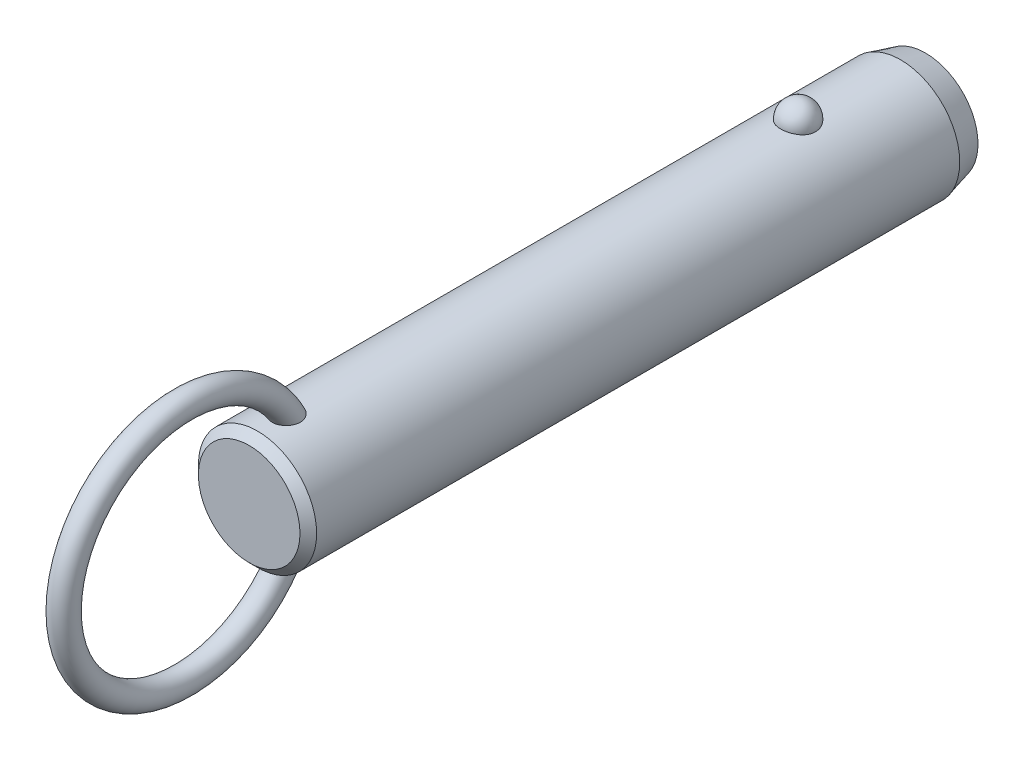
ISO-10303-21;
HEADER;
FILE_DESCRIPTION(('STEP AP214'),'2;1');
FILE_NAME('part.step','',(''),(''),'','','');
FILE_SCHEMA(('AUTOMOTIVE_DESIGN { 1 0 10303 214 1 1 1 1 }'));
ENDSEC;
DATA;
#1=APPLICATION_CONTEXT('core data for automotive mechanical design processes');
#2=APPLICATION_PROTOCOL_DEFINITION('international standard','automotive_design',2000,#1);
#3=PRODUCT_CONTEXT('',#1,'mechanical');
#4=PRODUCT('Part','Part','',(#3));
#5=PRODUCT_RELATED_PRODUCT_CATEGORY('part','',(#4));
#6=PRODUCT_DEFINITION_FORMATION('','',#4);
#7=PRODUCT_DEFINITION_CONTEXT('part definition',#1,'design');
#8=PRODUCT_DEFINITION('design','',#6,#7);
#9=PRODUCT_DEFINITION_SHAPE('','',#8);
#10=(LENGTH_UNIT() NAMED_UNIT(*) SI_UNIT(.MILLI.,.METRE.));
#11=(NAMED_UNIT(*) PLANE_ANGLE_UNIT() SI_UNIT($,.RADIAN.));
#12=(NAMED_UNIT(*) SI_UNIT($,.STERADIAN.) SOLID_ANGLE_UNIT());
#13=UNCERTAINTY_MEASURE_WITH_UNIT(LENGTH_MEASURE(1.E-05),#10,'distance_accuracy_value','');
#14=(GEOMETRIC_REPRESENTATION_CONTEXT(3) GLOBAL_UNCERTAINTY_ASSIGNED_CONTEXT((#13)) GLOBAL_UNIT_ASSIGNED_CONTEXT((#10,
#11,#12)) REPRESENTATION_CONTEXT('',''));
#15=CARTESIAN_POINT('',(0.,0.,0.));
#16=DIRECTION('',(0.,0.,1.));
#17=DIRECTION('',(1.,0.,0.));
#18=AXIS2_PLACEMENT_3D('',#15,#16,#17);
#19=CARTESIAN_POINT('',(0.,0.,55.9));
#20=DIRECTION('',(0.,0.,-1.));
#21=DIRECTION('',(-1.,0.,0.));
#22=AXIS2_PLACEMENT_3D('',#19,#20,#21);
#23=CYLINDRICAL_SURFACE('',#22,7.1);
#24=CARTESIAN_POINT('',(2.0769088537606,6.78943661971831,-2.1));
#25=CARTESIAN_POINT('',(2.07690739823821,6.78943796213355,-1.98268154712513));
#26=CARTESIAN_POINT('',(2.06738130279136,6.79237331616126,-1.86534506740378));
#27=CARTESIAN_POINT('',(2.0295040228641,6.8037853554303,-1.63400788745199));
#28=CARTESIAN_POINT('',(2.00114757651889,6.81226358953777,-1.52000812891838));
#29=CARTESIAN_POINT('',(1.92632025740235,6.83379798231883,-1.29863433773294));
#30=CARTESIAN_POINT('',(1.87985726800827,6.84685214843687,-1.19125744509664));
#31=CARTESIAN_POINT('',(1.76995205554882,6.87608091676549,-0.98604657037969));
#32=CARTESIAN_POINT('',(1.70650980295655,6.8922555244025,-0.88821260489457));
#33=CARTESIAN_POINT('',(1.5638119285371,6.92602930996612,-0.704242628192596));
#34=CARTESIAN_POINT('',(1.4844714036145,6.94363582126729,-0.618173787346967));
#35=CARTESIAN_POINT('',(1.31221746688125,6.97823658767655,-0.460740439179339));
#36=CARTESIAN_POINT('',(1.21930409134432,6.99523084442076,-0.389375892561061));
#37=CARTESIAN_POINT('',(1.02268781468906,7.02666176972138,-0.263547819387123));
#38=CARTESIAN_POINT('',(0.91902009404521,7.04110638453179,-0.209031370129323));
#39=CARTESIAN_POINT('',(0.703548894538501,7.06588726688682,-0.118163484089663));
#40=CARTESIAN_POINT('',(0.591746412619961,7.07622403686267,-0.0818098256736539));
#41=CARTESIAN_POINT('',(0.365557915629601,7.09147068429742,-0.0288711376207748));
#42=CARTESIAN_POINT('',(0.251267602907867,7.09648447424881,-0.0119070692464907));
#43=CARTESIAN_POINT('',(0.0213499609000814,7.10089837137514,0.00304925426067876));
#44=CARTESIAN_POINT('',(-0.0942772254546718,7.10029907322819,0.00104351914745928));
#45=CARTESIAN_POINT('',(-0.321651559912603,7.09360829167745,-0.0216931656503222));
#46=CARTESIAN_POINT('',(-0.433431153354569,7.08760388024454,-0.0421272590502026));
#47=CARTESIAN_POINT('',(-0.651862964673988,7.07086131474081,-0.100729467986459));
#48=CARTESIAN_POINT('',(-0.758515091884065,7.06012307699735,-0.138897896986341));
#49=CARTESIAN_POINT('',(-0.964449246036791,7.03496097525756,-0.232213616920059));
#50=CARTESIAN_POINT('',(-1.06368095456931,7.02051445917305,-0.287465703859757));
#51=CARTESIAN_POINT('',(-1.25145353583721,6.98948740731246,-0.413383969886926));
#52=CARTESIAN_POINT('',(-1.33999321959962,6.97290663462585,-0.48405186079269));
#53=CARTESIAN_POINT('',(-1.50591604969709,6.93898770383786,-0.640594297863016));
#54=CARTESIAN_POINT('',(-1.58302488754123,6.92164094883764,-0.726757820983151));
#55=CARTESIAN_POINT('',(-1.72189320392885,6.8884103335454,-0.91092752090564));
#56=CARTESIAN_POINT('',(-1.78365144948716,6.87252659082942,-1.008934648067));
#57=CARTESIAN_POINT('',(-1.89101272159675,6.84377189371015,-1.21549497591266));
#58=CARTESIAN_POINT('',(-1.93639553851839,6.83094274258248,-1.32416860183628));
#59=CARTESIAN_POINT('',(-2.00874275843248,6.81002070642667,-1.54791500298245));
#60=CARTESIAN_POINT('',(-2.03570774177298,6.80192767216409,-1.66298757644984));
#61=CARTESIAN_POINT('',(-2.07047276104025,6.7914266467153,-1.89571453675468));
#62=CARTESIAN_POINT('',(-2.07835878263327,6.78899315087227,-2.01335491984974));
#63=CARTESIAN_POINT('',(-2.07502083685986,6.79001409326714,-2.24833570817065));
#64=CARTESIAN_POINT('',(-2.06379746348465,6.7934683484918,-2.36567612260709));
#65=CARTESIAN_POINT('',(-2.02263913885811,6.80583442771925,-2.59603194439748));
#66=CARTESIAN_POINT('',(-1.99281127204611,6.81471501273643,-2.70906820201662));
#67=CARTESIAN_POINT('',(-1.91526639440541,6.83691232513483,-2.92836575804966));
#68=CARTESIAN_POINT('',(-1.8675486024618,6.85022924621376,-3.03462676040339));
#69=CARTESIAN_POINT('',(-1.75504492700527,6.87991336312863,-3.23806487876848));
#70=CARTESIAN_POINT('',(-1.69015924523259,6.89629822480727,-3.33518422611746));
#71=CARTESIAN_POINT('',(-1.54505404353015,6.93024852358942,-3.51697105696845));
#72=CARTESIAN_POINT('',(-1.46483385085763,6.94781401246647,-3.60163799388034));
#73=CARTESIAN_POINT('',(-1.29071406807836,6.98225977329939,-3.75654119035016));
#74=CARTESIAN_POINT('',(-1.19675650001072,6.99913673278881,-3.82671308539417));
#75=CARTESIAN_POINT('',(-0.997940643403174,7.03023618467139,-3.9501837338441));
#76=CARTESIAN_POINT('',(-0.89308318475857,7.04445887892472,-4.00348377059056));
#77=CARTESIAN_POINT('',(-0.676902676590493,7.06848365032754,-4.09107242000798));
#78=CARTESIAN_POINT('',(-0.565686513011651,7.0783430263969,-4.12560889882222));
#79=CARTESIAN_POINT('',(-0.338739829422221,7.09282534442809,-4.17575450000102));
#80=CARTESIAN_POINT('',(-0.223009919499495,7.09744899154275,-4.19136617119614));
#81=CARTESIAN_POINT('',(0.00707628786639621,7.10090930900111,-4.20307965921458));
#82=CARTESIAN_POINT('',(0.121410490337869,7.09986531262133,-4.19958377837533));
#83=CARTESIAN_POINT('',(0.347815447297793,7.092380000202,-4.17411564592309));
#84=CARTESIAN_POINT('',(0.459886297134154,7.08593891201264,-4.15214417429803));
#85=CARTESIAN_POINT('',(0.678084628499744,7.06838983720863,-4.09049562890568));
#86=CARTESIAN_POINT('',(0.784237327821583,7.05730369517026,-4.05090137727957));
#87=CARTESIAN_POINT('',(0.988305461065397,7.03163139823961,-3.95511447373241));
#88=CARTESIAN_POINT('',(1.08622031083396,7.01704499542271,-3.89892064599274));
#89=CARTESIAN_POINT('',(1.27284490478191,6.98562668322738,-3.77035541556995));
#90=CARTESIAN_POINT('',(1.36137372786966,6.96876135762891,-3.69772964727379));
#91=CARTESIAN_POINT('',(1.52509486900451,6.93477412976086,-3.53878279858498));
#92=CARTESIAN_POINT('',(1.60028496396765,6.91765218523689,-3.45245943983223));
#93=CARTESIAN_POINT('',(1.73681688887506,6.88465753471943,-3.26658774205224));
#94=CARTESIAN_POINT('',(1.79785966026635,6.86881574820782,-3.16681408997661));
#95=CARTESIAN_POINT('',(1.90265327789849,6.84053157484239,-2.95814408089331));
#96=CARTESIAN_POINT('',(1.94640861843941,6.82808830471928,-2.84925010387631));
#97=CARTESIAN_POINT('',(2.01274378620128,6.80881460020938,-2.63454318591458));
#98=CARTESIAN_POINT('',(2.03676193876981,6.80160856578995,-2.52920574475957));
#99=CARTESIAN_POINT('',(2.06884490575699,6.79191902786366,-2.3159172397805));
#100=CARTESIAN_POINT('',(2.07691019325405,6.78943538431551,-2.20796625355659));
#101=CARTESIAN_POINT('',(2.0769088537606,6.78943661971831,-2.1));
#102=B_SPLINE_CURVE_WITH_KNOTS('',3,(#24,#25,#26,#27,#28,#29,#30,#31,#32,#33,#34,#35,#36,#37,
#38,#39,#40,#41,#42,#43,#44,#45,#46,#47,#48,#49,#50,#51,#52,#53,#54,#55,#56,#57,#58,#59,#60,#61,
#62,#63,#64,#65,#66,#67,#68,#69,#70,#71,#72,#73,#74,#75,#76,#77,#78,#79,#80,#81,#82,#83,#84,#85,
#86,#87,#88,#89,#90,#91,#92,#93,#94,#95,#96,#97,#98,#99,#100,#101),.UNSPECIFIED.,.T.,.F.,(4,2,2,
2,2,2,2,2,2,2,2,2,2,2,2,2,2,2,2,2,2,2,2,2,2,2,2,2,2,2,2,2,2,2,2,2,2,2,4),(0.,0.351568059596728,
0.703234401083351,1.05474780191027,1.40626181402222,1.75970563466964,2.11314851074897,
2.4654696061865,2.81774759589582,3.16301449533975,3.50824481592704,3.84801136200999,
4.18778391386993,4.52968352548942,4.87162112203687,5.22076181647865,5.56993054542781,
5.92363364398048,6.27732559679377,6.62942052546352,6.98150450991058,7.33158042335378,
7.68167162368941,8.03384443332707,8.38603269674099,8.73975272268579,9.09344583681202,
9.44234545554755,9.79119807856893,10.1327344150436,10.4742563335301,10.8141898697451,
11.1541474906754,11.4997793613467,11.8454687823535,12.1979079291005,12.5502553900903,
12.8738073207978,13.1973496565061),.UNSPECIFIED.);
#103=CARTESIAN_POINT('',(2.0769088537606,6.78943661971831,-2.1));
#104=VERTEX_POINT('',#103);
#105=EDGE_CURVE('E41',#104,#104,#102,.T.);
#106=ORIENTED_EDGE('',*,*,#105,.T.);
#107=EDGE_LOOP('',(#106));
#108=FACE_BOUND('',#107,.T.);
#109=CARTESIAN_POINT('',(0.,0.,62.82));
#110=DIRECTION('',(0.,0.,1.));
#111=DIRECTION('',(1.,0.,0.));
#112=AXIS2_PLACEMENT_3D('',#109,#110,#111);
#113=CIRCLE('',#112,7.1);
#114=CARTESIAN_POINT('',(7.1,0.,62.82));
#115=VERTEX_POINT('',#114);
#116=EDGE_CURVE('E10',#115,#115,#113,.F.);
#117=ORIENTED_EDGE('',*,*,#116,.T.);
#118=EDGE_LOOP('',(#117));
#119=FACE_BOUND('',#118,.T.);
#120=CARTESIAN_POINT('',(-0.429539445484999,-7.08699541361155,57.6429212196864));
#121=CARTESIAN_POINT('',(-0.508331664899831,-7.08221999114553,57.6668764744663));
#122=CARTESIAN_POINT('',(-0.585039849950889,-7.07624016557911,57.6974570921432));
#123=CARTESIAN_POINT('',(-0.732082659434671,-7.06254296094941,57.7710242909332));
#124=CARTESIAN_POINT('',(-0.802417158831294,-7.05482554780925,57.8140111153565));
#125=CARTESIAN_POINT('',(-0.934722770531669,-7.03851844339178,57.9111135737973));
#126=CARTESIAN_POINT('',(-0.996700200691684,-7.02992941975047,57.9652207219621));
#127=CARTESIAN_POINT('',(-1.11079942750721,-7.01280697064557,58.0829676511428));
#128=CARTESIAN_POINT('',(-1.16292136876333,-7.00427354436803,58.1466072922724));
#129=CARTESIAN_POINT('',(-1.25705660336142,-6.98799959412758,58.2826870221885));
#130=CARTESIAN_POINT('',(-1.29888032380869,-6.98027525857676,58.3552598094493));
#131=CARTESIAN_POINT('',(-1.37069920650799,-6.96652886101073,58.5061686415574));
#132=CARTESIAN_POINT('',(-1.40069157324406,-6.96050720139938,58.5845060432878));
#133=CARTESIAN_POINT('',(-1.45043507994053,-6.95031881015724,58.7501903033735));
#134=CARTESIAN_POINT('',(-1.46937115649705,-6.94630231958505,58.8377897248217));
#135=CARTESIAN_POINT('',(-1.49424917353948,-6.94099239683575,59.0148714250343));
#136=CARTESIAN_POINT('',(-1.50018601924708,-6.93970003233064,59.1043544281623));
#137=CARTESIAN_POINT('',(-1.49978214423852,-6.93978815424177,59.2940607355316));
#138=CARTESIAN_POINT('',(-1.49187639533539,-6.94150934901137,59.394279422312));
#139=CARTESIAN_POINT('',(-1.46177925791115,-6.94790814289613,59.5924798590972));
#140=CARTESIAN_POINT('',(-1.43957541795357,-6.95258831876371,59.690459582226));
#141=CARTESIAN_POINT('',(-1.37783293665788,-6.96510647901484,59.8953629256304));
#142=CARTESIAN_POINT('',(-1.33634073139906,-6.97328848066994,60.0016801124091));
#143=CARTESIAN_POINT('',(-1.23686994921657,-6.99161706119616,60.2061777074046));
#144=CARTESIAN_POINT('',(-1.17889192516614,-7.00176357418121,60.3043583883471));
#145=CARTESIAN_POINT('',(-1.0587512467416,-7.02082898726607,60.4723743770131));
#146=CARTESIAN_POINT('',(-0.999247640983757,-7.02963746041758,60.5441230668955));
#147=CARTESIAN_POINT('',(-0.869494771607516,-7.04686074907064,60.6771959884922));
#148=CARTESIAN_POINT('',(-0.79926347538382,-7.05527619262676,60.7385372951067));
#149=CARTESIAN_POINT('',(-0.665408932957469,-7.06899457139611,60.8351316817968));
#150=CARTESIAN_POINT('',(-0.603817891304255,-7.07457275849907,60.8731512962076));
#151=CARTESIAN_POINT('',(-0.475172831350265,-7.08437420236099,60.9387581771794));
#152=CARTESIAN_POINT('',(-0.408123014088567,-7.08859848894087,60.9663533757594));
#153=CARTESIAN_POINT('',(-0.269431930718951,-7.09522749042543,61.0092569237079));
#154=CARTESIAN_POINT('',(-0.19775731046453,-7.09761688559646,61.0244618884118));
#155=CARTESIAN_POINT('',(-0.0527849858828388,-7.10017268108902,61.0407168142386));
#156=CARTESIAN_POINT('',(0.0205115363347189,-7.10034065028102,61.0417767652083));
#157=CARTESIAN_POINT('',(0.156426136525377,-7.09855986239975,61.0304619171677));
#158=CARTESIAN_POINT('',(0.219199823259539,-7.09688191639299,61.0198060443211));
#159=CARTESIAN_POINT('',(0.342134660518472,-7.09201880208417,60.9885379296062));
#160=CARTESIAN_POINT('',(0.402295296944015,-7.08883333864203,60.9679237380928));
#161=CARTESIAN_POINT('',(0.520687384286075,-7.08113868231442,60.9172125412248));
#162=CARTESIAN_POINT('',(0.578791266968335,-7.07658958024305,60.8868272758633));
#163=CARTESIAN_POINT('',(0.690173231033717,-7.06659708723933,60.8183678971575));
#164=CARTESIAN_POINT('',(0.743447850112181,-7.061153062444,60.7802883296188));
#165=CARTESIAN_POINT('',(0.870947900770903,-7.04680292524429,60.6765929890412));
#166=CARTESIAN_POINT('',(0.941828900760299,-7.0375580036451,60.6068972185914));
#167=CARTESIAN_POINT('',(1.07136606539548,-7.01900793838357,60.4569450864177));
#168=CARTESIAN_POINT('',(1.13000013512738,-7.00970271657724,60.3766700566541));
#169=CARTESIAN_POINT('',(1.23579584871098,-6.99183327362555,60.2068997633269));
#170=CARTESIAN_POINT('',(1.2827427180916,-6.98328455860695,60.1172696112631));
#171=CARTESIAN_POINT('',(1.36351442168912,-6.96796352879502,59.9321763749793));
#172=CARTESIAN_POINT('',(1.39733971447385,-6.96119115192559,59.8367134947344));
#173=CARTESIAN_POINT('',(1.45579181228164,-6.94922464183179,59.6253092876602));
#174=CARTESIAN_POINT('',(1.47790145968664,-6.94449000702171,59.508631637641));
#175=CARTESIAN_POINT('',(1.50168752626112,-6.93938731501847,59.2730153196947));
#176=CARTESIAN_POINT('',(1.50336085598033,-6.93901991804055,59.1540763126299));
#177=CARTESIAN_POINT('',(1.48486516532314,-6.9430010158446,58.9236079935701));
#178=CARTESIAN_POINT('',(1.46573441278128,-6.9471253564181,58.811995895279));
#179=CARTESIAN_POINT('',(1.40606892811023,-6.95944667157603,58.5948868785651));
#180=CARTESIAN_POINT('',(1.36556446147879,-6.96763788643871,58.4893815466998));
#181=CARTESIAN_POINT('',(1.27082700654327,-6.98548038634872,58.3042879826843));
#182=CARTESIAN_POINT('',(1.21949810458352,-6.99473841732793,58.2231719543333));
#183=CARTESIAN_POINT('',(1.10242050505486,-7.01414069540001,58.0722278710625));
#184=CARTESIAN_POINT('',(1.03668119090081,-7.02428436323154,58.0023925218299));
#185=CARTESIAN_POINT('',(0.900559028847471,-7.04295285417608,57.8835735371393));
#186=CARTESIAN_POINT('',(0.831428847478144,-7.05153466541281,57.8331573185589));
#187=CARTESIAN_POINT('',(0.68529187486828,-7.06723150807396,57.7451429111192));
#188=CARTESIAN_POINT('',(0.608287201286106,-7.0743469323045,57.7075412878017));
#189=CARTESIAN_POINT('',(0.451878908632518,-7.08602232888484,57.6474915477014));
#190=CARTESIAN_POINT('',(0.372686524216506,-7.09067127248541,57.6245088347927));
#191=CARTESIAN_POINT('',(0.211477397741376,-7.09730788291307,57.5920357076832));
#192=CARTESIAN_POINT('',(0.129460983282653,-7.09929585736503,57.5825437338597));
#193=CARTESIAN_POINT('',(-0.0332905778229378,-7.10037858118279,57.5773517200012));
#194=CARTESIAN_POINT('',(-0.114016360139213,-7.09953334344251,57.5813656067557));
#195=CARTESIAN_POINT('',(-0.273670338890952,-7.09517338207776,57.6024540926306));
#196=CARTESIAN_POINT('',(-0.352598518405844,-7.09165863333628,57.6195288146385));
#197=CARTESIAN_POINT('',(-0.429539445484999,-7.08699541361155,57.6429212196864));
#198=B_SPLINE_CURVE_WITH_KNOTS('',3,(#120,#121,#122,#123,#124,#125,#126,#127,#128,#129,#130,
#131,#132,#133,#134,#135,#136,#137,#138,#139,#140,#141,#142,#143,#144,#145,#146,#147,#148,#149,
#150,#151,#152,#153,#154,#155,#156,#157,#158,#159,#160,#161,#162,#163,#164,#165,#166,#167,#168,
#169,#170,#171,#172,#173,#174,#175,#176,#177,#178,#179,#180,#181,#182,#183,#184,#185,#186,#187,
#188,#189,#190,#191,#192,#193,#194,#195,#196,#197),.UNSPECIFIED.,.T.,.F.,(4,2,2,2,2,2,2,2,2,2,2,
2,2,2,2,2,2,2,2,2,2,2,2,2,2,2,2,2,2,2,2,2,2,2,2,2,2,2,4),(0.,0.247183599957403,
0.494372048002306,0.741372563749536,0.988369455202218,1.23962059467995,1.49093106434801,
1.75897818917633,2.02713035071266,2.32758265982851,2.62829697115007,2.9700873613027,
3.31186629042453,3.59175319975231,3.87117637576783,4.08813841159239,4.30493502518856,
4.52352259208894,4.74195577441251,4.93215328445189,5.12238804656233,5.31884850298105,
5.51544871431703,5.8133231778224,6.11173048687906,6.41527266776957,6.7188042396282,
7.07358156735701,7.4284125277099,7.76631485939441,8.10373999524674,8.3914224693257,
8.67891817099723,8.93560332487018,9.19221962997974,9.43881106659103,9.68537399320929,
9.92674752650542,10.1681233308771),.UNSPECIFIED.);
#199=CARTESIAN_POINT('',(-0.429539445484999,-7.08699541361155,57.6429212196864));
#200=VERTEX_POINT('',#199);
#201=EDGE_CURVE('E60',#200,#200,#198,.T.);
#202=ORIENTED_EDGE('',*,*,#201,.T.);
#203=EDGE_LOOP('',(#202));
#204=FACE_BOUND('',#203,.T.);
#205=CARTESIAN_POINT('',(-0.429539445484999,7.08699541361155,57.6429212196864));
#206=CARTESIAN_POINT('',(-0.351665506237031,7.09171429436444,57.6192469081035));
#207=CARTESIAN_POINT('',(-0.271733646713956,7.09525896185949,57.6020369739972));
#208=CARTESIAN_POINT('',(-0.11002645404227,7.09960839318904,57.5810059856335));
#209=CARTESIAN_POINT('',(-0.0282502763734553,7.10041187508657,57.577191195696));
#210=CARTESIAN_POINT('',(0.134782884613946,7.09918849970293,57.583059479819));
#211=CARTESIAN_POINT('',(0.21603995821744,7.09716214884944,57.5927401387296));
#212=CARTESIAN_POINT('',(0.375730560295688,7.09050177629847,57.6253471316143));
#213=CARTESIAN_POINT('',(0.454164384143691,7.08586802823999,57.6482720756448));
#214=CARTESIAN_POINT('',(0.606025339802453,7.07449911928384,57.706771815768));
#215=CARTESIAN_POINT('',(0.679451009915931,7.06776334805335,57.7423502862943));
#216=CARTESIAN_POINT('',(0.819234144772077,7.05292866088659,57.8251753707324));
#217=CARTESIAN_POINT('',(0.885591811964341,7.04482978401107,57.8724216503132));
#218=CARTESIAN_POINT('',(1.00993211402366,7.02808709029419,57.9775902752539));
#219=CARTESIAN_POINT('',(1.06785399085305,7.01943990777,58.035583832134));
#220=CARTESIAN_POINT('',(1.17342527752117,7.00256662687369,58.1603013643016));
#221=CARTESIAN_POINT('',(1.22107408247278,6.99434055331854,58.2270258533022));
#222=CARTESIAN_POINT('',(1.30652927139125,6.97889183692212,58.3693622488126));
#223=CARTESIAN_POINT('',(1.34399711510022,6.97170674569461,58.4451808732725));
#224=CARTESIAN_POINT('',(1.40682616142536,6.95930080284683,58.6018100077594));
#225=CARTESIAN_POINT('',(1.43218374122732,6.95408053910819,58.6826220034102));
#226=CARTESIAN_POINT('',(1.47246409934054,6.94566853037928,58.8535314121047));
#227=CARTESIAN_POINT('',(1.48642590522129,6.9426653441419,58.9438630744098));
#228=CARTESIAN_POINT('',(1.5011410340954,6.93949744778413,59.125619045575));
#229=CARTESIAN_POINT('',(1.50188917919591,6.93933385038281,59.2170437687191));
#230=CARTESIAN_POINT('',(1.49030464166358,6.94183245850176,59.4108438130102));
#231=CARTESIAN_POINT('',(1.47627413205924,6.94486147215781,59.513112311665));
#232=CARTESIAN_POINT('',(1.43356351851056,6.95380194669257,59.7144719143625));
#233=CARTESIAN_POINT('',(1.4048676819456,6.95971650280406,59.8135594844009));
#234=CARTESIAN_POINT('',(1.32908750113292,6.97461208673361,60.0189087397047));
#235=CARTESIAN_POINT('',(1.28011435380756,6.98388945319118,60.1244566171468));
#236=CARTESIAN_POINT('',(1.16520357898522,7.00397743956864,60.3257604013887));
#237=CARTESIAN_POINT('',(1.09927694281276,7.01478706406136,60.4215225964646));
#238=CARTESIAN_POINT('',(0.969361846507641,7.03373936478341,60.5767565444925));
#239=CARTESIAN_POINT('',(0.909042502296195,7.04187023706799,60.6393032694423));
#240=CARTESIAN_POINT('',(0.779178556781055,7.05741732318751,60.7540535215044));
#241=CARTESIAN_POINT('',(0.709649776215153,7.06483472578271,60.8062744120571));
#242=CARTESIAN_POINT('',(0.576854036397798,7.0767751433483,60.8881138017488));
#243=CARTESIAN_POINT('',(0.515118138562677,7.08158033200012,60.9201641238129));
#244=CARTESIAN_POINT('',(0.38712798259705,7.08972701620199,60.9737656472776));
#245=CARTESIAN_POINT('',(0.320877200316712,7.09306962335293,60.9953248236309));
#246=CARTESIAN_POINT('',(0.185041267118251,7.09791507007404,61.0264005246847));
#247=CARTESIAN_POINT('',(0.115437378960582,7.09940591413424,61.0358385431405));
#248=CARTESIAN_POINT('',(-0.0243157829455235,7.10030171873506,61.0415226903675));
#249=CARTESIAN_POINT('',(-0.094464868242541,7.0997073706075,61.0377731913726));
#250=CARTESIAN_POINT('',(-0.225713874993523,7.09668414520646,61.0185081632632));
#251=CARTESIAN_POINT('',(-0.287006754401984,7.09444865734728,61.0042323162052));
#252=CARTESIAN_POINT('',(-0.40655537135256,7.08860360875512,60.9663685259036));
#253=CARTESIAN_POINT('',(-0.464809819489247,7.08499346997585,60.9427766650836));
#254=CARTESIAN_POINT('',(-0.594955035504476,7.07541654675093,60.8789232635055));
#255=CARTESIAN_POINT('',(-0.665389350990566,7.06906574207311,60.835753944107));
#256=CARTESIAN_POINT('',(-0.798242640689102,7.05530261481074,60.738587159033));
#257=CARTESIAN_POINT('',(-0.860645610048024,7.0478882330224,60.6845686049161));
#258=CARTESIAN_POINT('',(-0.994249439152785,7.03045217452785,60.5509965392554));
#259=CARTESIAN_POINT('',(-1.06260129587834,7.02030745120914,60.4686143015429));
#260=CARTESIAN_POINT('',(-1.18502045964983,7.00068382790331,60.293843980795));
#261=CARTESIAN_POINT('',(-1.23907684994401,6.99120544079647,60.201448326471));
#262=CARTESIAN_POINT('',(-1.33335589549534,6.97384343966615,60.0080085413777));
#263=CARTESIAN_POINT('',(-1.3733613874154,6.96598557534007,59.9068564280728));
#264=CARTESIAN_POINT('',(-1.43770677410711,6.9529905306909,59.6995046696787));
#265=CARTESIAN_POINT('',(-1.46204473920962,6.94785368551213,59.59330440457));
#266=CARTESIAN_POINT('',(-1.49537533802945,6.94076296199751,59.3682317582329));
#267=CARTESIAN_POINT('',(-1.50273564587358,6.93914842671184,59.2490975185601));
#268=CARTESIAN_POINT('',(-1.4954555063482,6.94072368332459,59.0114703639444));
#269=CARTESIAN_POINT('',(-1.48082914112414,6.94391040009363,58.8929770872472));
#270=CARTESIAN_POINT('',(-1.43076401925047,6.95438579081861,58.6734325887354));
#271=CARTESIAN_POINT('',(-1.39762227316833,6.96121852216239,58.5718413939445));
#272=CARTESIAN_POINT('',(-1.31211274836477,6.97783941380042,58.3773513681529));
#273=CARTESIAN_POINT('',(-1.25976607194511,6.98762432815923,58.2844431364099));
#274=CARTESIAN_POINT('',(-1.14583073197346,7.00713153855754,58.1241601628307));
#275=CARTESIAN_POINT('',(-1.0866594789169,7.01665982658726,58.0550351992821));
#276=CARTESIAN_POINT('',(-0.956606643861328,7.03556646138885,57.9288786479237));
#277=CARTESIAN_POINT('',(-0.885737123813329,7.04494495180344,57.8718347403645));
#278=CARTESIAN_POINT('',(-0.75155804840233,7.06035735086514,57.7831004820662));
#279=CARTESIAN_POINT('',(-0.690120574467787,7.0666695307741,57.7485932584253));
#280=CARTESIAN_POINT('',(-0.56281546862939,7.07794609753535,57.6887507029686));
#281=CARTESIAN_POINT('',(-0.496948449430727,7.08291067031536,57.6634141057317));
#282=CARTESIAN_POINT('',(-0.429539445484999,7.08699541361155,57.6429212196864));
#283=B_SPLINE_CURVE_WITH_KNOTS('',3,(#205,#206,#207,#208,#209,#210,#211,#212,#213,#214,#215,
#216,#217,#218,#219,#220,#221,#222,#223,#224,#225,#226,#227,#228,#229,#230,#231,#232,#233,#234,
#235,#236,#237,#238,#239,#240,#241,#242,#243,#244,#245,#246,#247,#248,#249,#250,#251,#252,#253,
#254,#255,#256,#257,#258,#259,#260,#261,#262,#263,#264,#265,#266,#267,#268,#269,#270,#271,#272,
#273,#274,#275,#276,#277,#278,#279,#280,#281,#282),.UNSPECIFIED.,.T.,.F.,(4,2,2,2,2,2,2,2,2,2,2,
2,2,2,2,2,2,2,2,2,2,2,2,2,2,2,2,2,2,2,2,2,2,2,2,2,2,2,4),(0.,0.244335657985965,0.48878556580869,
0.733191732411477,0.977572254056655,1.22202379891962,1.46646834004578,1.71259457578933,
1.9587352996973,2.21226768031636,2.46587585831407,2.73913816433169,3.01250754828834,
3.32109936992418,3.63002293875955,3.97863512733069,4.32702187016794,4.58793945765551,
4.84841449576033,5.05676704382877,5.26496096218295,5.47449661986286,5.68396281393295,
5.8720544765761,6.06022532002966,6.30743751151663,6.55513496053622,6.87602468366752,
7.19715875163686,7.52305774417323,7.84899686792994,8.20516155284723,8.56109821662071,
8.88040084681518,9.19935367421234,9.47236282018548,9.7450922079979,9.95662250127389,
10.1681235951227),.UNSPECIFIED.);
#284=CARTESIAN_POINT('',(-0.429539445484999,7.08699541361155,57.6429212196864));
#285=VERTEX_POINT('',#284);
#286=EDGE_CURVE('E68',#285,#285,#283,.T.);
#287=ORIENTED_EDGE('',*,*,#286,.T.);
#288=EDGE_LOOP('',(#287));
#289=FACE_BOUND('',#288,.T.);
#290=CARTESIAN_POINT('',(0.,0.,-14.3999999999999));
#291=DIRECTION('',(0.,0.,-1.));
#292=DIRECTION('',(-1.,0.,0.));
#293=AXIS2_PLACEMENT_3D('',#290,#291,#292);
#294=CIRCLE('',#293,7.1);
#295=CARTESIAN_POINT('',(7.1,0.,-14.3999999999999));
#296=VERTEX_POINT('',#295);
#297=EDGE_CURVE('E57',#296,#296,#294,.F.);
#298=ORIENTED_EDGE('',*,*,#297,.T.);
#299=EDGE_LOOP('',(#298));
#300=FACE_BOUND('',#299,.T.);
#301=ADVANCED_FACE('F37',(#108,#119,#204,#289,#300),#23,.T.);
#302=CARTESIAN_POINT('',(0.,0.,-17.4));
#303=DIRECTION('',(0.,0.,-1.));
#304=DIRECTION('',(-1.,0.,0.));
#305=AXIS2_PLACEMENT_3D('',#302,#303,#304);
#306=PLANE('',#305);
#307=CARTESIAN_POINT('',(0.,0.,-17.4));
#308=DIRECTION('',(0.,0.,-1.));
#309=DIRECTION('',(-1.,0.,0.));
#310=AXIS2_PLACEMENT_3D('',#307,#308,#309);
#311=CIRCLE('',#310,6.29615242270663);
#312=CARTESIAN_POINT('',(6.29615242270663,0.,-17.4));
#313=VERTEX_POINT('',#312);
#314=EDGE_CURVE('E67',#313,#313,#311,.T.);
#315=ORIENTED_EDGE('',*,*,#314,.T.);
#316=EDGE_LOOP('',(#315));
#317=FACE_BOUND('',#316,.T.);
#318=ADVANCED_FACE('F86',(#317),#306,.T.);
#319=CARTESIAN_POINT('',(0.,0.,-17.4));
#320=DIRECTION('',(0.,0.,1.));
#321=DIRECTION('',(1.,0.,0.));
#322=AXIS2_PLACEMENT_3D('',#319,#320,#321);
#323=CONICAL_SURFACE('',#322,6.29615242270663,0.261799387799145);
#324=CARTESIAN_POINT('',(7.1,0.,-14.3999999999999));
#325=CARTESIAN_POINT('',(7.09162658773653,0.,-14.4312499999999));
#326=CARTESIAN_POINT('',(7.08325317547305,0.,-14.4624999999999));
#327=CARTESIAN_POINT('',(7.06650635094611,0.,-14.5249999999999));
#328=CARTESIAN_POINT('',(7.05813293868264,0.,-14.5562499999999));
#329=CARTESIAN_POINT('',(7.04138611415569,0.,-14.6187499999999));
#330=CARTESIAN_POINT('',(7.03301270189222,0.,-14.6499999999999));
#331=CARTESIAN_POINT('',(7.01626587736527,0.,-14.7124999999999));
#332=CARTESIAN_POINT('',(7.0078924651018,0.,-14.7437499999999));
#333=CARTESIAN_POINT('',(6.99114564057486,0.,-14.8062499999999));
#334=CARTESIAN_POINT('',(6.98277222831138,0.,-14.8374999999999));
#335=CARTESIAN_POINT('',(6.96602540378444,0.,-14.8999999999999));
#336=CARTESIAN_POINT('',(6.95765199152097,0.,-14.9312499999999));
#337=CARTESIAN_POINT('',(6.94090516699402,0.,-14.9937499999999));
#338=CARTESIAN_POINT('',(6.93253175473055,0.,-15.0249999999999));
#339=CARTESIAN_POINT('',(6.9157849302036,0.,-15.0874999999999));
#340=CARTESIAN_POINT('',(6.90741151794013,0.,-15.1187499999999));
#341=CARTESIAN_POINT('',(6.89066469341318,0.,-15.1812499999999));
#342=CARTESIAN_POINT('',(6.88229128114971,0.,-15.2125));
#343=CARTESIAN_POINT('',(6.86554445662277,0.,-15.275));
#344=CARTESIAN_POINT('',(6.85717104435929,0.,-15.30625));
#345=CARTESIAN_POINT('',(6.84042421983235,0.,-15.36875));
#346=CARTESIAN_POINT('',(6.83205080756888,0.,-15.4));
#347=CARTESIAN_POINT('',(6.81530398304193,0.,-15.4625));
#348=CARTESIAN_POINT('',(6.80693057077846,0.,-15.49375));
#349=CARTESIAN_POINT('',(6.79018374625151,0.,-15.55625));
#350=CARTESIAN_POINT('',(6.78181033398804,0.,-15.5875));
#351=CARTESIAN_POINT('',(6.7650635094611,0.,-15.65));
#352=CARTESIAN_POINT('',(6.75669009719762,0.,-15.68125));
#353=CARTESIAN_POINT('',(6.73994327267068,0.,-15.74375));
#354=CARTESIAN_POINT('',(6.7315698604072,0.,-15.775));
#355=CARTESIAN_POINT('',(6.71482303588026,0.,-15.8375));
#356=CARTESIAN_POINT('',(6.70644962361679,0.,-15.86875));
#357=CARTESIAN_POINT('',(6.68970279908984,0.,-15.93125));
#358=CARTESIAN_POINT('',(6.68132938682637,0.,-15.9625));
#359=CARTESIAN_POINT('',(6.66458256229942,0.,-16.025));
#360=CARTESIAN_POINT('',(6.65620915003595,0.,-16.05625));
#361=CARTESIAN_POINT('',(6.63946232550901,0.,-16.11875));
#362=CARTESIAN_POINT('',(6.63108891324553,0.,-16.15));
#363=CARTESIAN_POINT('',(6.61434208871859,0.,-16.2125));
#364=CARTESIAN_POINT('',(6.60596867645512,0.,-16.24375));
#365=CARTESIAN_POINT('',(6.58922185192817,0.,-16.30625));
#366=CARTESIAN_POINT('',(6.5808484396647,0.,-16.3375));
#367=CARTESIAN_POINT('',(6.56410161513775,0.,-16.4));
#368=CARTESIAN_POINT('',(6.55572820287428,0.,-16.43125));
#369=CARTESIAN_POINT('',(6.53898137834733,0.,-16.49375));
#370=CARTESIAN_POINT('',(6.53060796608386,0.,-16.525));
#371=CARTESIAN_POINT('',(6.51386114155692,0.,-16.5875));
#372=CARTESIAN_POINT('',(6.50548772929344,0.,-16.61875));
#373=CARTESIAN_POINT('',(6.4887409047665,0.,-16.68125));
#374=CARTESIAN_POINT('',(6.48036749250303,0.,-16.7125));
#375=CARTESIAN_POINT('',(6.46362066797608,0.,-16.775));
#376=CARTESIAN_POINT('',(6.45524725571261,0.,-16.80625));
#377=CARTESIAN_POINT('',(6.43850043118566,0.,-16.86875));
#378=CARTESIAN_POINT('',(6.43012701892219,0.,-16.9));
#379=CARTESIAN_POINT('',(6.41338019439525,0.,-16.9625));
#380=CARTESIAN_POINT('',(6.40500678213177,0.,-16.99375));
#381=CARTESIAN_POINT('',(6.38825995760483,0.,-17.05625));
#382=CARTESIAN_POINT('',(6.37988654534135,0.,-17.0875));
#383=CARTESIAN_POINT('',(6.36313972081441,0.,-17.15));
#384=CARTESIAN_POINT('',(6.35476630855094,0.,-17.18125));
#385=CARTESIAN_POINT('',(6.33801948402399,0.,-17.24375));
#386=CARTESIAN_POINT('',(6.32964607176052,0.,-17.275));
#387=CARTESIAN_POINT('',(6.31289924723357,0.,-17.3375));
#388=CARTESIAN_POINT('',(6.3045258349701,0.,-17.36875));
#389=CARTESIAN_POINT('',(6.29615242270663,0.,-17.4));
#390=B_SPLINE_CURVE_WITH_KNOTS('',3,(#324,#325,#326,#327,#328,#329,#330,#331,#332,#333,#334,
#335,#336,#337,#338,#339,#340,#341,#342,#343,#344,#345,#346,#347,#348,#349,#350,#351,#352,#353,
#354,#355,#356,#357,#358,#359,#360,#361,#362,#363,#364,#365,#366,#367,#368,#369,#370,#371,#372,
#373,#374,#375,#376,#377,#378,#379,#380,#381,#382,#383,#384,#385,#386,#387,#388,#389),
.UNSPECIFIED.,.F.,.F.,(4,2,2,2,2,2,2,2,2,2,2,2,2,2,2,2,2,2,2,2,2,2,2,2,2,2,2,2,2,2,2,2,4),(0.,
0.0970571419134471,0.194114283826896,0.291171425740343,0.38822856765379,0.485285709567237,
0.582342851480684,0.679399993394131,0.776457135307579,0.873514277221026,0.970571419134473,
1.06762856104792,1.16468570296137,1.26174284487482,1.35879998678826,1.45585712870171,
1.55291427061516,1.6499714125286,1.74702855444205,1.8440856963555,1.94114283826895,
2.03819998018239,2.13525712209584,2.23231426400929,2.32937140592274,2.42642854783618,
2.52348568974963,2.62054283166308,2.71759997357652,2.81465711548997,2.91171425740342,
3.00877139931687,3.10582854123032),.UNSPECIFIED.);
#391=EDGE_CURVE('BSEAM84',#296,#313,#390,.T.);
#392=ORIENTED_EDGE('',*,*,#297,.F.);
#393=ORIENTED_EDGE('',*,*,#314,.F.);
#394=ORIENTED_EDGE('',*,*,#391,.T.);
#395=ORIENTED_EDGE('',*,*,#391,.F.);
#396=EDGE_LOOP('',(#392,#394,#393,#395));
#397=FACE_BOUND('',#396,.T.);
#398=ADVANCED_FACE('F84',(#397),#323,.T.);
#399=CARTESIAN_POINT('',(0.,0.,63.82));
#400=DIRECTION('',(0.,0.,1.));
#401=DIRECTION('',(1.,0.,0.));
#402=AXIS2_PLACEMENT_3D('',#399,#400,#401);
#403=PLANE('',#402);
#404=CARTESIAN_POINT('',(0.,0.,63.82));
#405=DIRECTION('',(0.,0.,1.));
#406=DIRECTION('',(1.,0.,0.));
#407=AXIS2_PLACEMENT_3D('',#404,#405,#406);
#408=CIRCLE('',#407,6.09999999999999);
#409=CARTESIAN_POINT('',(6.09999999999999,0.,63.82));
#410=VERTEX_POINT('',#409);
#411=EDGE_CURVE('E50',#410,#410,#408,.T.);
#412=ORIENTED_EDGE('',*,*,#411,.T.);
#413=EDGE_LOOP('',(#412));
#414=FACE_BOUND('',#413,.T.);
#415=ADVANCED_FACE('F78',(#414),#403,.T.);
#416=CARTESIAN_POINT('',(0.,0.,71.75));
#417=DIRECTION('',(1.,0.,0.));
#418=DIRECTION('',(0.,0.,-1.));
#419=AXIS2_PLACEMENT_3D('',#416,#417,#418);
#420=TOROIDAL_SURFACE('',#419,14.35,1.5);
#421=ORIENTED_EDGE('',*,*,#286,.F.);
#422=EDGE_LOOP('',(#421));
#423=FACE_BOUND('',#422,.T.);
#424=ORIENTED_EDGE('',*,*,#201,.F.);
#425=EDGE_LOOP('',(#424));
#426=FACE_BOUND('',#425,.T.);
#427=ADVANCED_FACE('F74',(#423,#426),#420,.T.);
#428=CARTESIAN_POINT('',(0.,0.,63.82));
#429=DIRECTION('',(0.,0.,-1.));
#430=DIRECTION('',(-1.,0.,0.));
#431=AXIS2_PLACEMENT_3D('',#428,#429,#430);
#432=CONICAL_SURFACE('',#431,6.09999999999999,0.785398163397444);
#433=ORIENTED_EDGE('',*,*,#116,.F.);
#434=EDGE_LOOP('',(#433));
#435=FACE_BOUND('',#434,.T.);
#436=ORIENTED_EDGE('',*,*,#411,.F.);
#437=EDGE_LOOP('',(#436));
#438=FACE_BOUND('',#437,.T.);
#439=ADVANCED_FACE('F39',(#435,#438),#432,.T.);
#440=CARTESIAN_POINT('',(0.,7.1,-2.1));
#441=DIRECTION('',(0.,1.,0.));
#442=DIRECTION('',(0.,0.,1.));
#443=AXIS2_PLACEMENT_3D('',#440,#441,#442);
#444=SPHERICAL_SURFACE('',#443,2.10000000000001);
#445=ORIENTED_EDGE('',*,*,#105,.F.);
#446=EDGE_LOOP('',(#445));
#447=FACE_BOUND('',#446,.T.);
#448=ADVANCED_FACE('F80',(#447),#444,.T.);
#449=CLOSED_SHELL('',(#301,#318,#398,#415,#427,#439,#448));
#450=MANIFOLD_SOLID_BREP('B2',#449);
#451=ADVANCED_BREP_SHAPE_REPRESENTATION('',(#18,#450),#14);
#452=SHAPE_DEFINITION_REPRESENTATION(#9,#451);
ENDSEC;
END-ISO-10303-21;
